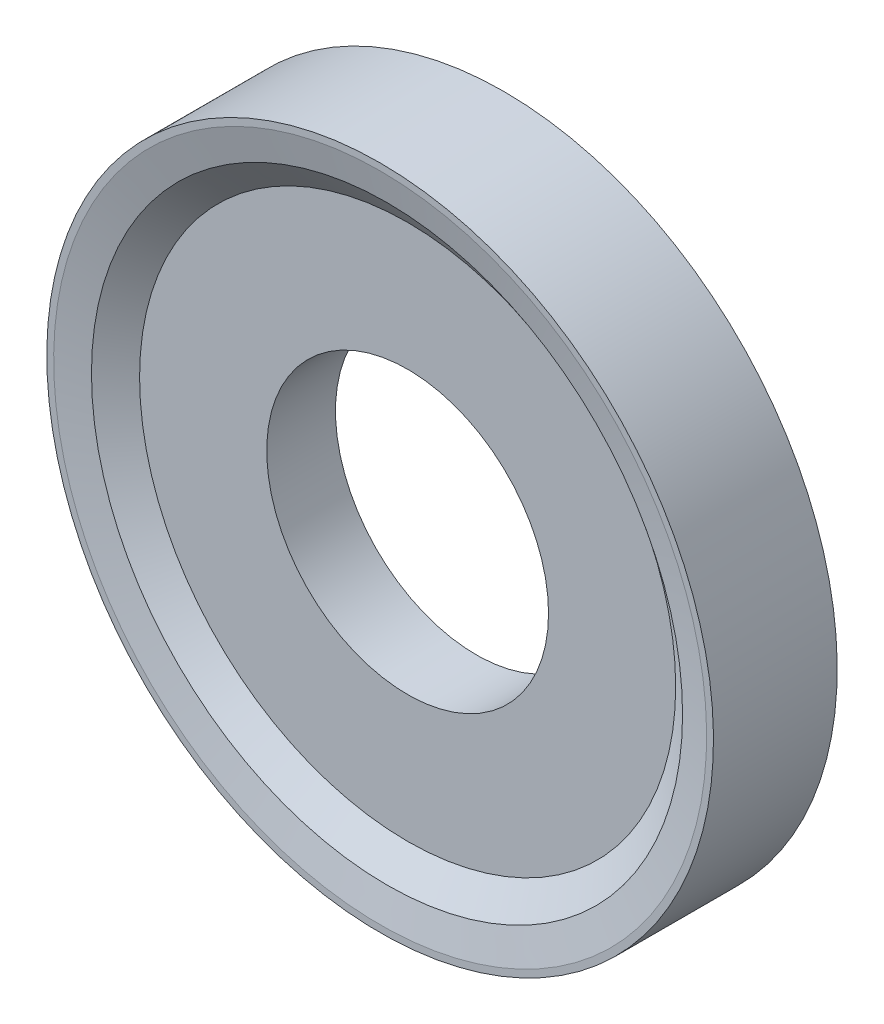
ISO-10303-21;
HEADER;
FILE_DESCRIPTION(('STEP AP214'),'2;1');
FILE_NAME('part.step','',(''),(''),'','','');
FILE_SCHEMA(('AUTOMOTIVE_DESIGN { 1 0 10303 214 1 1 1 1 }'));
ENDSEC;
DATA;
#1=APPLICATION_CONTEXT('core data for automotive mechanical design processes');
#2=APPLICATION_PROTOCOL_DEFINITION('international standard','automotive_design',2000,#1);
#3=PRODUCT_CONTEXT('',#1,'mechanical');
#4=PRODUCT('Part','Part','',(#3));
#5=PRODUCT_RELATED_PRODUCT_CATEGORY('part','',(#4));
#6=PRODUCT_DEFINITION_FORMATION('','',#4);
#7=PRODUCT_DEFINITION_CONTEXT('part definition',#1,'design');
#8=PRODUCT_DEFINITION('design','',#6,#7);
#9=PRODUCT_DEFINITION_SHAPE('','',#8);
#10=(LENGTH_UNIT() NAMED_UNIT(*) SI_UNIT(.MILLI.,.METRE.));
#11=(NAMED_UNIT(*) PLANE_ANGLE_UNIT() SI_UNIT($,.RADIAN.));
#12=(NAMED_UNIT(*) SI_UNIT($,.STERADIAN.) SOLID_ANGLE_UNIT());
#13=UNCERTAINTY_MEASURE_WITH_UNIT(LENGTH_MEASURE(1.E-05),#10,'distance_accuracy_value','');
#14=(GEOMETRIC_REPRESENTATION_CONTEXT(3) GLOBAL_UNCERTAINTY_ASSIGNED_CONTEXT((#13)) GLOBAL_UNIT_ASSIGNED_CONTEXT((#10,
#11,#12)) REPRESENTATION_CONTEXT('',''));
#15=CARTESIAN_POINT('',(0.,0.,0.));
#16=DIRECTION('',(0.,0.,1.));
#17=DIRECTION('',(1.,0.,0.));
#18=AXIS2_PLACEMENT_3D('',#15,#16,#17);
#19=CARTESIAN_POINT('',(3.9,0.,1.4));
#20=DIRECTION('',(0.,0.,1.));
#21=DIRECTION('',(0.,-1.,0.));
#22=AXIS2_PLACEMENT_3D('',#19,#20,#21);
#23=PLANE('',#22);
#24=CARTESIAN_POINT('',(0.,0.,1.4));
#25=DIRECTION('',(0.,0.,-1.));
#26=DIRECTION('',(0.,1.,0.));
#27=AXIS2_PLACEMENT_3D('',#24,#25,#26);
#28=CIRCLE('',#27,3.9);
#29=CARTESIAN_POINT('',(0.,3.9,1.4));
#30=VERTEX_POINT('',#29);
#31=EDGE_CURVE('E40',#30,#30,#28,.T.);
#32=ORIENTED_EDGE('',*,*,#31,.F.);
#33=EDGE_LOOP('',(#32));
#34=FACE_BOUND('',#33,.T.);
#35=CARTESIAN_POINT('',(0.,0.,1.4));
#36=DIRECTION('',(0.,0.,1.));
#37=DIRECTION('',(1.,0.,0.));
#38=AXIS2_PLACEMENT_3D('',#35,#36,#37);
#39=CIRCLE('',#38,2.05);
#40=CARTESIAN_POINT('',(2.05,0.,1.4));
#41=VERTEX_POINT('',#40);
#42=EDGE_CURVE('E44',#41,#41,#39,.T.);
#43=ORIENTED_EDGE('',*,*,#42,.F.);
#44=EDGE_LOOP('',(#43));
#45=FACE_BOUND('',#44,.T.);
#46=ADVANCED_FACE('F12',(#34,#45),#23,.T.);
#47=CARTESIAN_POINT('',(2.1,0.,0.4));
#48=DIRECTION('',(0.,0.,-1.));
#49=DIRECTION('',(0.,1.,0.));
#50=AXIS2_PLACEMENT_3D('',#47,#48,#49);
#51=PLANE('',#50);
#52=CARTESIAN_POINT('',(0.,0.,0.4));
#53=DIRECTION('',(0.,0.,-1.));
#54=DIRECTION('',(0.,1.,0.));
#55=AXIS2_PLACEMENT_3D('',#52,#53,#54);
#56=CIRCLE('',#55,3.9);
#57=CARTESIAN_POINT('',(0.,3.9,0.4));
#58=VERTEX_POINT('',#57);
#59=EDGE_CURVE('E8',#58,#58,#56,.T.);
#60=ORIENTED_EDGE('',*,*,#59,.T.);
#61=EDGE_LOOP('',(#60));
#62=FACE_BOUND('',#61,.T.);
#63=CARTESIAN_POINT('',(0.,0.,0.4));
#64=DIRECTION('',(0.,0.,1.));
#65=DIRECTION('',(1.,0.,0.));
#66=AXIS2_PLACEMENT_3D('',#63,#64,#65);
#67=CIRCLE('',#66,2.05);
#68=CARTESIAN_POINT('',(2.05,0.,0.4));
#69=VERTEX_POINT('',#68);
#70=EDGE_CURVE('E43',#69,#69,#67,.T.);
#71=ORIENTED_EDGE('',*,*,#70,.T.);
#72=EDGE_LOOP('',(#71));
#73=FACE_BOUND('',#72,.T.);
#74=ADVANCED_FACE('F50',(#62,#73),#51,.T.);
#75=CARTESIAN_POINT('',(0.,0.,0.4));
#76=DIRECTION('',(0.,0.,-1.));
#77=DIRECTION('',(0.,1.,0.));
#78=AXIS2_PLACEMENT_3D('',#75,#76,#77);
#79=CONICAL_SURFACE('',#78,3.9,0.927295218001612);
#80=CARTESIAN_POINT('',(0.,0.,0.1));
#81=DIRECTION('',(0.,0.,-1.));
#82=DIRECTION('',(0.,1.,0.));
#83=AXIS2_PLACEMENT_3D('',#80,#81,#82);
#84=CIRCLE('',#83,4.3);
#85=CARTESIAN_POINT('',(0.,4.3,0.1));
#86=VERTEX_POINT('',#85);
#87=EDGE_CURVE('E18',#86,#86,#84,.T.);
#88=ORIENTED_EDGE('',*,*,#87,.T.);
#89=EDGE_LOOP('',(#88));
#90=FACE_BOUND('',#89,.T.);
#91=ORIENTED_EDGE('',*,*,#59,.F.);
#92=EDGE_LOOP('',(#91));
#93=FACE_BOUND('',#92,.T.);
#94=ADVANCED_FACE('F65',(#90,#93),#79,.F.);
#95=CARTESIAN_POINT('',(0.,0.,0.1));
#96=DIRECTION('',(0.,0.,-1.));
#97=DIRECTION('',(0.,1.,0.));
#98=AXIS2_PLACEMENT_3D('',#95,#96,#97);
#99=CONICAL_SURFACE('',#98,4.3,1.35212738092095);
#100=CARTESIAN_POINT('',(0.,0.,0.));
#101=DIRECTION('',(0.,0.,-1.));
#102=DIRECTION('',(0.,1.,0.));
#103=AXIS2_PLACEMENT_3D('',#100,#101,#102);
#104=CIRCLE('',#103,4.75);
#105=CARTESIAN_POINT('',(0.,4.75,0.));
#106=VERTEX_POINT('',#105);
#107=EDGE_CURVE('E22',#106,#106,#104,.T.);
#108=ORIENTED_EDGE('',*,*,#107,.T.);
#109=EDGE_LOOP('',(#108));
#110=FACE_BOUND('',#109,.T.);
#111=ORIENTED_EDGE('',*,*,#87,.F.);
#112=EDGE_LOOP('',(#111));
#113=FACE_BOUND('',#112,.T.);
#114=ADVANCED_FACE('F94',(#110,#113),#99,.F.);
#115=CARTESIAN_POINT('',(4.75,0.,0.));
#116=DIRECTION('',(0.,0.,-1.));
#117=DIRECTION('',(0.,1.,0.));
#118=AXIS2_PLACEMENT_3D('',#115,#116,#117);
#119=PLANE('',#118);
#120=CARTESIAN_POINT('',(0.,0.,0.));
#121=DIRECTION('',(0.,0.,-1.));
#122=DIRECTION('',(0.,1.,0.));
#123=AXIS2_PLACEMENT_3D('',#120,#121,#122);
#124=CIRCLE('',#123,4.85);
#125=CARTESIAN_POINT('',(0.,4.85,0.));
#126=VERTEX_POINT('',#125);
#127=EDGE_CURVE('E26',#126,#126,#124,.T.);
#128=ORIENTED_EDGE('',*,*,#127,.T.);
#129=EDGE_LOOP('',(#128));
#130=FACE_BOUND('',#129,.T.);
#131=ORIENTED_EDGE('',*,*,#107,.F.);
#132=EDGE_LOOP('',(#131));
#133=FACE_BOUND('',#132,.T.);
#134=ADVANCED_FACE('F88',(#130,#133),#119,.T.);
#135=CARTESIAN_POINT('',(0.,0.,0.));
#136=DIRECTION('',(0.,0.,-1.));
#137=DIRECTION('',(0.,1.,0.));
#138=AXIS2_PLACEMENT_3D('',#135,#136,#137);
#139=CYLINDRICAL_SURFACE('',#138,4.85);
#140=CARTESIAN_POINT('',(0.,0.,1.8));
#141=DIRECTION('',(0.,0.,-1.));
#142=DIRECTION('',(0.,1.,0.));
#143=AXIS2_PLACEMENT_3D('',#140,#141,#142);
#144=CIRCLE('',#143,4.85);
#145=CARTESIAN_POINT('',(0.,4.85,1.8));
#146=VERTEX_POINT('',#145);
#147=EDGE_CURVE('E31',#146,#146,#144,.T.);
#148=ORIENTED_EDGE('',*,*,#147,.T.);
#149=EDGE_LOOP('',(#148));
#150=FACE_BOUND('',#149,.T.);
#151=ORIENTED_EDGE('',*,*,#127,.F.);
#152=EDGE_LOOP('',(#151));
#153=FACE_BOUND('',#152,.T.);
#154=ADVANCED_FACE('F82',(#150,#153),#139,.T.);
#155=CARTESIAN_POINT('',(4.85,0.,1.8));
#156=DIRECTION('',(0.,0.,1.));
#157=DIRECTION('',(0.,-1.,0.));
#158=AXIS2_PLACEMENT_3D('',#155,#156,#157);
#159=PLANE('',#158);
#160=CARTESIAN_POINT('',(0.,0.,1.8));
#161=DIRECTION('',(0.,0.,-1.));
#162=DIRECTION('',(0.,1.,0.));
#163=AXIS2_PLACEMENT_3D('',#160,#161,#162);
#164=CIRCLE('',#163,4.75);
#165=CARTESIAN_POINT('',(0.,4.75,1.8));
#166=VERTEX_POINT('',#165);
#167=EDGE_CURVE('E34',#166,#166,#164,.T.);
#168=ORIENTED_EDGE('',*,*,#167,.T.);
#169=EDGE_LOOP('',(#168));
#170=FACE_BOUND('',#169,.T.);
#171=ORIENTED_EDGE('',*,*,#147,.F.);
#172=EDGE_LOOP('',(#171));
#173=FACE_BOUND('',#172,.T.);
#174=ADVANCED_FACE('F76',(#170,#173),#159,.T.);
#175=CARTESIAN_POINT('',(0.,0.,1.8));
#176=DIRECTION('',(0.,0.,1.));
#177=DIRECTION('',(0.,-1.,0.));
#178=AXIS2_PLACEMENT_3D('',#175,#176,#177);
#179=CONICAL_SURFACE('',#178,4.75,1.35212738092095);
#180=CARTESIAN_POINT('',(0.,0.,1.7));
#181=DIRECTION('',(0.,0.,-1.));
#182=DIRECTION('',(0.,1.,0.));
#183=AXIS2_PLACEMENT_3D('',#180,#181,#182);
#184=CIRCLE('',#183,4.3);
#185=CARTESIAN_POINT('',(0.,4.3,1.7));
#186=VERTEX_POINT('',#185);
#187=EDGE_CURVE('E37',#186,#186,#184,.T.);
#188=ORIENTED_EDGE('',*,*,#187,.T.);
#189=EDGE_LOOP('',(#188));
#190=FACE_BOUND('',#189,.T.);
#191=ORIENTED_EDGE('',*,*,#167,.F.);
#192=EDGE_LOOP('',(#191));
#193=FACE_BOUND('',#192,.T.);
#194=ADVANCED_FACE('F70',(#190,#193),#179,.F.);
#195=CARTESIAN_POINT('',(0.,0.,1.7));
#196=DIRECTION('',(0.,0.,1.));
#197=DIRECTION('',(0.,-1.,0.));
#198=AXIS2_PLACEMENT_3D('',#195,#196,#197);
#199=CONICAL_SURFACE('',#198,4.3,0.927295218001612);
#200=ORIENTED_EDGE('',*,*,#31,.T.);
#201=EDGE_LOOP('',(#200));
#202=FACE_BOUND('',#201,.T.);
#203=ORIENTED_EDGE('',*,*,#187,.F.);
#204=EDGE_LOOP('',(#203));
#205=FACE_BOUND('',#204,.T.);
#206=ADVANCED_FACE('F55',(#202,#205),#199,.F.);
#207=CARTESIAN_POINT('',(0.,0.,0.4));
#208=DIRECTION('',(0.,0.,1.));
#209=DIRECTION('',(1.,0.,0.));
#210=AXIS2_PLACEMENT_3D('',#207,#208,#209);
#211=CYLINDRICAL_SURFACE('',#210,2.05);
#212=ORIENTED_EDGE('',*,*,#70,.F.);
#213=EDGE_LOOP('',(#212));
#214=FACE_BOUND('',#213,.T.);
#215=ORIENTED_EDGE('',*,*,#42,.T.);
#216=EDGE_LOOP('',(#215));
#217=FACE_BOUND('',#216,.T.);
#218=ADVANCED_FACE('F52',(#214,#217),#211,.F.);
#219=CLOSED_SHELL('',(#46,#74,#94,#114,#134,#154,#174,#194,#206,#218));
#220=MANIFOLD_SOLID_BREP('B1',#219);
#221=ADVANCED_BREP_SHAPE_REPRESENTATION('',(#18,#220),#14);
#222=SHAPE_DEFINITION_REPRESENTATION(#9,#221);
ENDSEC;
END-ISO-10303-21;
